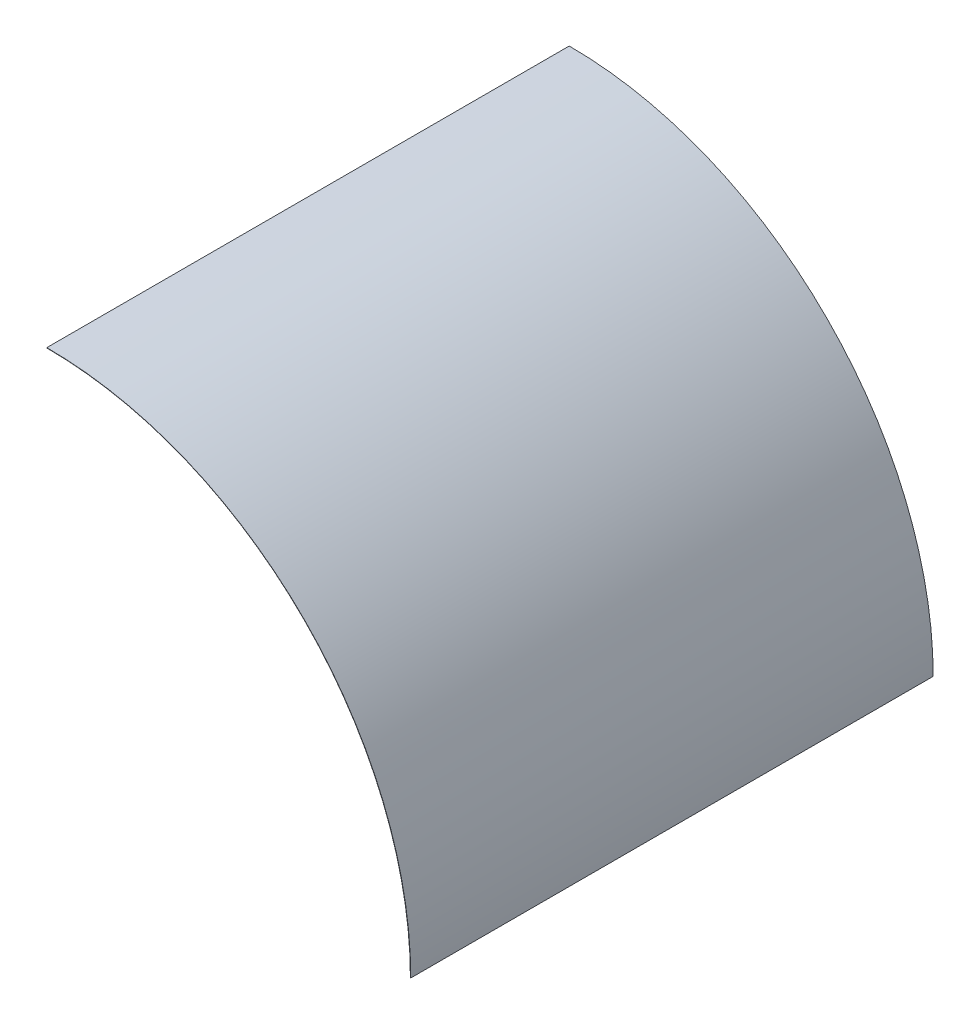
ISO-10303-21;
HEADER;
FILE_DESCRIPTION(('STEP AP214'),'2;1');
FILE_NAME('part.step','',(''),(''),'','','');
FILE_SCHEMA(('AUTOMOTIVE_DESIGN { 1 0 10303 214 1 1 1 1 }'));
ENDSEC;
DATA;
#1=APPLICATION_CONTEXT('core data for automotive mechanical design processes');
#2=APPLICATION_PROTOCOL_DEFINITION('international standard','automotive_design',2000,#1);
#3=PRODUCT_CONTEXT('',#1,'mechanical');
#4=PRODUCT('Part','Part','',(#3));
#5=PRODUCT_RELATED_PRODUCT_CATEGORY('part','',(#4));
#6=PRODUCT_DEFINITION_FORMATION('','',#4);
#7=PRODUCT_DEFINITION_CONTEXT('part definition',#1,'design');
#8=PRODUCT_DEFINITION('design','',#6,#7);
#9=PRODUCT_DEFINITION_SHAPE('','',#8);
#10=(LENGTH_UNIT() NAMED_UNIT(*) SI_UNIT(.MILLI.,.METRE.));
#11=(NAMED_UNIT(*) PLANE_ANGLE_UNIT() SI_UNIT($,.RADIAN.));
#12=(NAMED_UNIT(*) SI_UNIT($,.STERADIAN.) SOLID_ANGLE_UNIT());
#13=UNCERTAINTY_MEASURE_WITH_UNIT(LENGTH_MEASURE(1.E-05),#10,'distance_accuracy_value','');
#14=(GEOMETRIC_REPRESENTATION_CONTEXT(3) GLOBAL_UNCERTAINTY_ASSIGNED_CONTEXT((#13)) GLOBAL_UNIT_ASSIGNED_CONTEXT((#10,
#11,#12)) REPRESENTATION_CONTEXT('',''));
#15=CARTESIAN_POINT('',(0.,0.,0.));
#16=DIRECTION('',(0.,0.,1.));
#17=DIRECTION('',(1.,0.,0.));
#18=AXIS2_PLACEMENT_3D('',#15,#16,#17);
#19=CARTESIAN_POINT('',(0.,0.,-3000.));
#20=DIRECTION('',(0.,0.,1.));
#21=DIRECTION('',(1.,0.,0.));
#22=AXIS2_PLACEMENT_3D('',#19,#20,#21);
#23=CYLINDRICAL_SURFACE('',#22,2088.);
#24=CARTESIAN_POINT('',(0.,0.,0.));
#25=DIRECTION('',(0.,0.,-1.));
#26=DIRECTION('',(-1.,0.,0.));
#27=AXIS2_PLACEMENT_3D('',#24,#25,#26);
#28=CIRCLE('',#27,2088.);
#29=CARTESIAN_POINT('',(0.,2088.,0.));
#30=VERTEX_POINT('',#29);
#31=CARTESIAN_POINT('',(2088.,0.,0.));
#32=VERTEX_POINT('',#31);
#33=EDGE_CURVE('E97',#30,#32,#28,.T.);
#34=ORIENTED_EDGE('',*,*,#33,.F.);
#35=DIRECTION('',(0.,0.,1.));
#36=VECTOR('',#35,1.);
#37=CARTESIAN_POINT('',(0.,2088.,-3000.));
#38=LINE('',#37,#36);
#39=CARTESIAN_POINT('',(0.,2088.,-3000.));
#40=VERTEX_POINT('',#39);
#41=EDGE_CURVE('E11',#40,#30,#38,.T.);
#42=ORIENTED_EDGE('',*,*,#41,.F.);
#43=CARTESIAN_POINT('',(0.,0.,-3000.));
#44=DIRECTION('',(0.,0.,-1.));
#45=DIRECTION('',(-1.,0.,0.));
#46=AXIS2_PLACEMENT_3D('',#43,#44,#45);
#47=CIRCLE('',#46,2088.);
#48=CARTESIAN_POINT('',(2088.,0.,-3000.));
#49=VERTEX_POINT('',#48);
#50=EDGE_CURVE('E91',#40,#49,#47,.T.);
#51=ORIENTED_EDGE('',*,*,#50,.T.);
#52=DIRECTION('',(0.,0.,1.));
#53=VECTOR('',#52,1.);
#54=CARTESIAN_POINT('',(2088.,0.,-3000.));
#55=LINE('',#54,#53);
#56=EDGE_CURVE('E36',#49,#32,#55,.T.);
#57=ORIENTED_EDGE('',*,*,#56,.T.);
#58=EDGE_LOOP('',(#34,#42,#51,#57));
#59=FACE_BOUND('',#58,.T.);
#60=ADVANCED_FACE('F33',(#59),#23,.F.);
#61=CARTESIAN_POINT('',(0.,2090.,-3000.));
#62=DIRECTION('',(-1.,0.,0.));
#63=DIRECTION('',(0.,0.,1.));
#64=AXIS2_PLACEMENT_3D('',#61,#62,#63);
#65=PLANE('',#64);
#66=DIRECTION('',(0.,-1.,0.));
#67=VECTOR('',#66,1.);
#68=CARTESIAN_POINT('',(0.,2090.,0.));
#69=LINE('',#68,#67);
#70=CARTESIAN_POINT('',(0.,2090.,0.));
#71=VERTEX_POINT('',#70);
#72=EDGE_CURVE('E93',#71,#30,#69,.T.);
#73=ORIENTED_EDGE('',*,*,#72,.F.);
#74=DIRECTION('',(0.,0.,1.));
#75=VECTOR('',#74,1.);
#76=CARTESIAN_POINT('',(0.,2090.,-3000.));
#77=LINE('',#76,#75);
#78=CARTESIAN_POINT('',(0.,2090.,-3000.));
#79=VERTEX_POINT('',#78);
#80=EDGE_CURVE('E42',#79,#71,#77,.T.);
#81=ORIENTED_EDGE('',*,*,#80,.F.);
#82=DIRECTION('',(0.,-1.,0.));
#83=VECTOR('',#82,1.);
#84=CARTESIAN_POINT('',(0.,2090.,-3000.));
#85=LINE('',#84,#83);
#86=EDGE_CURVE('E88',#79,#40,#85,.T.);
#87=ORIENTED_EDGE('',*,*,#86,.T.);
#88=ORIENTED_EDGE('',*,*,#41,.T.);
#89=EDGE_LOOP('',(#73,#81,#87,#88));
#90=FACE_BOUND('',#89,.T.);
#91=ADVANCED_FACE('F107',(#90),#65,.T.);
#92=CARTESIAN_POINT('',(0.,0.,-3000.));
#93=DIRECTION('',(0.,0.,1.));
#94=DIRECTION('',(1.,0.,0.));
#95=AXIS2_PLACEMENT_3D('',#92,#93,#94);
#96=CYLINDRICAL_SURFACE('',#95,2090.);
#97=CARTESIAN_POINT('',(0.,0.,0.));
#98=DIRECTION('',(0.,0.,1.));
#99=DIRECTION('',(-1.,0.,0.));
#100=AXIS2_PLACEMENT_3D('',#97,#98,#99);
#101=CIRCLE('',#100,2090.);
#102=CARTESIAN_POINT('',(2090.,2.55951181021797E-13,0.));
#103=VERTEX_POINT('',#102);
#104=EDGE_CURVE('E83',#103,#71,#101,.T.);
#105=ORIENTED_EDGE('',*,*,#104,.F.);
#106=DIRECTION('',(0.,0.,1.));
#107=VECTOR('',#106,1.);
#108=CARTESIAN_POINT('',(2090.,2.55951181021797E-13,-3000.));
#109=LINE('',#108,#107);
#110=CARTESIAN_POINT('',(2090.,2.55951181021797E-13,-3000.));
#111=VERTEX_POINT('',#110);
#112=EDGE_CURVE('E78',#111,#103,#109,.T.);
#113=ORIENTED_EDGE('',*,*,#112,.F.);
#114=CARTESIAN_POINT('',(0.,0.,-3000.));
#115=DIRECTION('',(0.,0.,1.));
#116=DIRECTION('',(-1.,0.,0.));
#117=AXIS2_PLACEMENT_3D('',#114,#115,#116);
#118=CIRCLE('',#117,2090.);
#119=EDGE_CURVE('E81',#111,#79,#118,.T.);
#120=ORIENTED_EDGE('',*,*,#119,.T.);
#121=ORIENTED_EDGE('',*,*,#80,.T.);
#122=EDGE_LOOP('',(#105,#113,#120,#121));
#123=FACE_BOUND('',#122,.T.);
#124=ADVANCED_FACE('F80',(#123),#96,.T.);
#125=CARTESIAN_POINT('',(2090.,0.,-3000.));
#126=DIRECTION('',(0.,-1.,0.));
#127=DIRECTION('',(0.,0.,-1.));
#128=AXIS2_PLACEMENT_3D('',#125,#126,#127);
#129=PLANE('',#128);
#130=DIRECTION('',(1.,0.,0.));
#131=VECTOR('',#130,1.);
#132=CARTESIAN_POINT('',(2090.,0.,0.));
#133=LINE('',#132,#131);
#134=EDGE_CURVE('E100',#32,#103,#133,.T.);
#135=ORIENTED_EDGE('',*,*,#134,.F.);
#136=ORIENTED_EDGE('',*,*,#56,.F.);
#137=DIRECTION('',(1.,0.,0.));
#138=VECTOR('',#137,1.);
#139=CARTESIAN_POINT('',(2090.,0.,-3000.));
#140=LINE('',#139,#138);
#141=EDGE_CURVE('E87',#49,#111,#140,.T.);
#142=ORIENTED_EDGE('',*,*,#141,.T.);
#143=ORIENTED_EDGE('',*,*,#112,.T.);
#144=EDGE_LOOP('',(#135,#136,#142,#143));
#145=FACE_BOUND('',#144,.T.);
#146=ADVANCED_FACE('F90',(#145),#129,.T.);
#147=CARTESIAN_POINT('',(0.,0.,-3000.));
#148=DIRECTION('',(0.,0.,-1.));
#149=DIRECTION('',(-1.,0.,0.));
#150=AXIS2_PLACEMENT_3D('',#147,#148,#149);
#151=PLANE('',#150);
#152=ORIENTED_EDGE('',*,*,#50,.F.);
#153=ORIENTED_EDGE('',*,*,#86,.F.);
#154=ORIENTED_EDGE('',*,*,#119,.F.);
#155=ORIENTED_EDGE('',*,*,#141,.F.);
#156=EDGE_LOOP('',(#152,#153,#154,#155));
#157=FACE_BOUND('',#156,.T.);
#158=ADVANCED_FACE('F86',(#157),#151,.T.);
#159=CARTESIAN_POINT('',(0.,0.,0.));
#160=DIRECTION('',(0.,0.,-1.));
#161=DIRECTION('',(-1.,0.,0.));
#162=AXIS2_PLACEMENT_3D('',#159,#160,#161);
#163=PLANE('',#162);
#164=ORIENTED_EDGE('',*,*,#33,.T.);
#165=ORIENTED_EDGE('',*,*,#134,.T.);
#166=ORIENTED_EDGE('',*,*,#104,.T.);
#167=ORIENTED_EDGE('',*,*,#72,.T.);
#168=EDGE_LOOP('',(#164,#165,#166,#167));
#169=FACE_BOUND('',#168,.T.);
#170=ADVANCED_FACE('F106',(#169),#163,.F.);
#171=CLOSED_SHELL('',(#60,#91,#124,#146,#158,#170));
#172=MANIFOLD_SOLID_BREP('B2',#171);
#173=ADVANCED_BREP_SHAPE_REPRESENTATION('',(#18,#172),#14);
#174=SHAPE_DEFINITION_REPRESENTATION(#9,#173);
ENDSEC;
END-ISO-10303-21;
